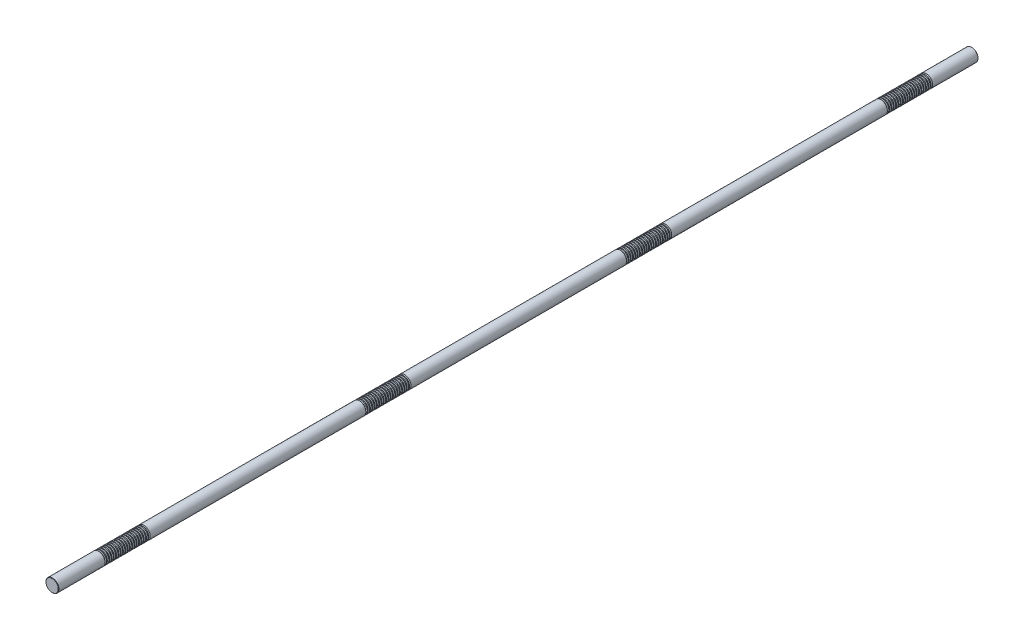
from build123d import *

# Parameters (mm, degrees)
SKETCH1_R           = 14
BOSS_EXTRUDE1_DEPTH = 1000
CHAMFER1_SIZE       = 0.7
LPATTERN1_COUNT     = 20
LPATTERN1_PITCH     = 5
LPATTERN2_COUNT     = 4
LPATTERN2_PITCH     = 567


with BuildPart() as part:
    # Sketch1 → Boss-Extrude1 (new, symmetric)
    with BuildSketch(Plane.XY):
        Circle(SKETCH1_R)
    extrude(amount=BOSS_EXTRUDE1_DEPTH, both=True)

    # Chamfer1
    chamfer1_edges = [part.edges().sort_by_distance(p)[0] for p in [
        (-14, 0, -1000),
        (-14, 0, 1000),
    ]]
    chamfer(chamfer1_edges, length=CHAMFER1_SIZE)

    # Sketch2 → Cut-Revolve1 (revolve, cut)
    with BuildSketch(Plane(origin=(0, 0, 0), x_dir=(0, 0, -1), z_dir=(1, 0, 0)), mode=Mode.PRIVATE) as cut_revolve1_sk:
        Polygon((900.36843014, 14), (897.13156986, 14), (897.86843014, 11.25), (899.63156986, 11.25), align=None)
    cut_revolve1 = revolve(cut_revolve1_sk.sketch.rotate(Axis((0, 0, 1000), (0, 0, -1)), 90), axis=Axis((0, 0, 1000), (0, 0, -1)), mode=Mode.SUBTRACT)

    # LPattern1: Cut-Revolve1 ×20
    with Locations(*[(0, 0, i * LPATTERN1_PITCH) for i in range(1, LPATTERN1_COUNT)]):
        add(cut_revolve1, mode=Mode.SUBTRACT)

    # LPattern2: Cut-Revolve1 ×4
    with Locations(*[(0, 0, i * LPATTERN2_PITCH) for i in range(1, LPATTERN2_COUNT)]):
        add(cut_revolve1, mode=Mode.SUBTRACT)

    # LPattern2 copy 1 sketch → LPattern2 copy 1 (revolve, cut)
    with BuildSketch(Plane(origin=(0, 0, 572), x_dir=(0, 0, -1), z_dir=(1, 0, 0))):
        Polygon((900.36843014, 14), (897.13156986, 14), (897.86843014, 11.25), (899.63156986, 11.25), align=None)
    revolve(axis=Axis((0, 0, 1572), (0, 0, -1)), mode=Mode.SUBTRACT)

    # LPattern2 copy 2 sketch → LPattern2 copy 2 (revolve, cut)
    with BuildSketch(Plane(origin=(0, 0, 1139), x_dir=(0, 0, -1), z_dir=(1, 0, 0))):
        Polygon((900.36843014, 14), (897.13156986, 14), (897.86843014, 11.25), (899.63156986, 11.25), align=None)
    revolve(axis=Axis((0, 0, 2139), (0, 0, -1)), mode=Mode.SUBTRACT)

    # LPattern2 copy 3 sketch → LPattern2 copy 3 (revolve, cut)
    with BuildSketch(Plane(origin=(0, 0, 1706), x_dir=(0, 0, -1), z_dir=(1, 0, 0))):
        Polygon((900.36843014, 14), (897.13156986, 14), (897.86843014, 11.25), (899.63156986, 11.25), align=None)
    revolve(axis=Axis((0, 0, 2706), (0, 0, -1)), mode=Mode.SUBTRACT)

    # LPattern2 copy 4 sketch → LPattern2 copy 4 (revolve, cut)
    with BuildSketch(Plane(origin=(0, 0, 577), x_dir=(0, 0, -1), z_dir=(1, 0, 0))):
        Polygon((900.36843014, 14), (897.13156986, 14), (897.86843014, 11.25), (899.63156986, 11.25), align=None)
    revolve(axis=Axis((0, 0, 1577), (0, 0, -1)), mode=Mode.SUBTRACT)

    # LPattern2 copy 5 sketch → LPattern2 copy 5 (revolve, cut)
    with BuildSketch(Plane(origin=(0, 0, 1144), x_dir=(0, 0, -1), z_dir=(1, 0, 0))):
        Polygon((900.36843014, 14), (897.13156986, 14), (897.86843014, 11.25), (899.63156986, 11.25), align=None)
    revolve(axis=Axis((0, 0, 2144), (0, 0, -1)), mode=Mode.SUBTRACT)

    # LPattern2 copy 6 sketch → LPattern2 copy 6 (revolve, cut)
    with BuildSketch(Plane(origin=(0, 0, 1711), x_dir=(0, 0, -1), z_dir=(1, 0, 0))):
        Polygon((900.36843014, 14), (897.13156986, 14), (897.86843014, 11.25), (899.63156986, 11.25), align=None)
    revolve(axis=Axis((0, 0, 2711), (0, 0, -1)), mode=Mode.SUBTRACT)

    # LPattern2 copy 7 sketch → LPattern2 copy 7 (revolve, cut)
    with BuildSketch(Plane(origin=(0, 0, 582), x_dir=(0, 0, -1), z_dir=(1, 0, 0))):
        Polygon((900.36843014, 14), (897.13156986, 14), (897.86843014, 11.25), (899.63156986, 11.25), align=None)
    revolve(axis=Axis((0, 0, 1582), (0, 0, -1)), mode=Mode.SUBTRACT)

    # LPattern2 copy 8 sketch → LPattern2 copy 8 (revolve, cut)
    with BuildSketch(Plane(origin=(0, 0, 1149), x_dir=(0, 0, -1), z_dir=(1, 0, 0))):
        Polygon((900.36843014, 14), (897.13156986, 14), (897.86843014, 11.25), (899.63156986, 11.25), align=None)
    revolve(axis=Axis((0, 0, 2149), (0, 0, -1)), mode=Mode.SUBTRACT)

    # LPattern2 copy 9 sketch → LPattern2 copy 9 (revolve, cut)
    with BuildSketch(Plane(origin=(0, 0, 1716), x_dir=(0, 0, -1), z_dir=(1, 0, 0))):
        Polygon((900.36843014, 14), (897.13156986, 14), (897.86843014, 11.25), (899.63156986, 11.25), align=None)
    revolve(axis=Axis((0, 0, 2716), (0, 0, -1)), mode=Mode.SUBTRACT)

    # LPattern2 copy 10 sketch → LPattern2 copy 10 (revolve, cut)
    with BuildSketch(Plane(origin=(0, 0, 587), x_dir=(0, 0, -1), z_dir=(1, 0, 0))):
        Polygon((900.36843014, 14), (897.13156986, 14), (897.86843014, 11.25), (899.63156986, 11.25), align=None)
    revolve(axis=Axis((0, 0, 1587), (0, 0, -1)), mode=Mode.SUBTRACT)

    # LPattern2 copy 11 sketch → LPattern2 copy 11 (revolve, cut)
    with BuildSketch(Plane(origin=(0, 0, 1154), x_dir=(0, 0, -1), z_dir=(1, 0, 0))):
        Polygon((900.36843014, 14), (897.13156986, 14), (897.86843014, 11.25), (899.63156986, 11.25), align=None)
    revolve(axis=Axis((0, 0, 2154), (0, 0, -1)), mode=Mode.SUBTRACT)

    # LPattern2 copy 12 sketch → LPattern2 copy 12 (revolve, cut)
    with BuildSketch(Plane(origin=(0, 0, 1721), x_dir=(0, 0, -1), z_dir=(1, 0, 0))):
        Polygon((900.36843014, 14), (897.13156986, 14), (897.86843014, 11.25), (899.63156986, 11.25), align=None)
    revolve(axis=Axis((0, 0, 2721), (0, 0, -1)), mode=Mode.SUBTRACT)

    # LPattern2 copy 13 sketch → LPattern2 copy 13 (revolve, cut)
    with BuildSketch(Plane(origin=(0, 0, 592), x_dir=(0, 0, -1), z_dir=(1, 0, 0))):
        Polygon((900.36843014, 14), (897.13156986, 14), (897.86843014, 11.25), (899.63156986, 11.25), align=None)
    revolve(axis=Axis((0, 0, 1592), (0, 0, -1)), mode=Mode.SUBTRACT)

    # LPattern2 copy 14 sketch → LPattern2 copy 14 (revolve, cut)
    with BuildSketch(Plane(origin=(0, 0, 1159), x_dir=(0, 0, -1), z_dir=(1, 0, 0))):
        Polygon((900.36843014, 14), (897.13156986, 14), (897.86843014, 11.25), (899.63156986, 11.25), align=None)
    revolve(axis=Axis((0, 0, 2159), (0, 0, -1)), mode=Mode.SUBTRACT)

    # LPattern2 copy 15 sketch → LPattern2 copy 15 (revolve, cut)
    with BuildSketch(Plane(origin=(0, 0, 1726), x_dir=(0, 0, -1), z_dir=(1, 0, 0))):
        Polygon((900.36843014, 14), (897.13156986, 14), (897.86843014, 11.25), (899.63156986, 11.25), align=None)
    revolve(axis=Axis((0, 0, 2726), (0, 0, -1)), mode=Mode.SUBTRACT)

    # LPattern2 copy 16 sketch → LPattern2 copy 16 (revolve, cut)
    with BuildSketch(Plane(origin=(0, 0, 597), x_dir=(0, 0, -1), z_dir=(1, 0, 0))):
        Polygon((900.36843014, 14), (897.13156986, 14), (897.86843014, 11.25), (899.63156986, 11.25), align=None)
    revolve(axis=Axis((0, 0, 1597), (0, 0, -1)), mode=Mode.SUBTRACT)

    # LPattern2 copy 17 sketch → LPattern2 copy 17 (revolve, cut)
    with BuildSketch(Plane(origin=(0, 0, 1164), x_dir=(0, 0, -1), z_dir=(1, 0, 0))):
        Polygon((900.36843014, 14), (897.13156986, 14), (897.86843014, 11.25), (899.63156986, 11.25), align=None)
    revolve(axis=Axis((0, 0, 2164), (0, 0, -1)), mode=Mode.SUBTRACT)

    # LPattern2 copy 18 sketch → LPattern2 copy 18 (revolve, cut)
    with BuildSketch(Plane(origin=(0, 0, 1731), x_dir=(0, 0, -1), z_dir=(1, 0, 0))):
        Polygon((900.36843014, 14), (897.13156986, 14), (897.86843014, 11.25), (899.63156986, 11.25), align=None)
    revolve(axis=Axis((0, 0, 2731), (0, 0, -1)), mode=Mode.SUBTRACT)

    # LPattern2 copy 19 sketch → LPattern2 copy 19 (revolve, cut)
    with BuildSketch(Plane(origin=(0, 0, 602), x_dir=(0, 0, -1), z_dir=(1, 0, 0))):
        Polygon((900.36843014, 14), (897.13156986, 14), (897.86843014, 11.25), (899.63156986, 11.25), align=None)
    revolve(axis=Axis((0, 0, 1602), (0, 0, -1)), mode=Mode.SUBTRACT)

    # LPattern2 copy 20 sketch → LPattern2 copy 20 (revolve, cut)
    with BuildSketch(Plane(origin=(0, 0, 1169), x_dir=(0, 0, -1), z_dir=(1, 0, 0))):
        Polygon((900.36843014, 14), (897.13156986, 14), (897.86843014, 11.25), (899.63156986, 11.25), align=None)
    revolve(axis=Axis((0, 0, 2169), (0, 0, -1)), mode=Mode.SUBTRACT)

    # LPattern2 copy 21 sketch → LPattern2 copy 21 (revolve, cut)
    with BuildSketch(Plane(origin=(0, 0, 1736), x_dir=(0, 0, -1), z_dir=(1, 0, 0))):
        Polygon((900.36843014, 14), (897.13156986, 14), (897.86843014, 11.25), (899.63156986, 11.25), align=None)
    revolve(axis=Axis((0, 0, 2736), (0, 0, -1)), mode=Mode.SUBTRACT)

    # LPattern2 copy 22 sketch → LPattern2 copy 22 (revolve, cut)
    with BuildSketch(Plane(origin=(0, 0, 607), x_dir=(0, 0, -1), z_dir=(1, 0, 0))):
        Polygon((900.36843014, 14), (897.13156986, 14), (897.86843014, 11.25), (899.63156986, 11.25), align=None)
    revolve(axis=Axis((0, 0, 1607), (0, 0, -1)), mode=Mode.SUBTRACT)

    # LPattern2 copy 23 sketch → LPattern2 copy 23 (revolve, cut)
    with BuildSketch(Plane(origin=(0, 0, 1174), x_dir=(0, 0, -1), z_dir=(1, 0, 0))):
        Polygon((900.36843014, 14), (897.13156986, 14), (897.86843014, 11.25), (899.63156986, 11.25), align=None)
    revolve(axis=Axis((0, 0, 2174), (0, 0, -1)), mode=Mode.SUBTRACT)

    # LPattern2 copy 24 sketch → LPattern2 copy 24 (revolve, cut)
    with BuildSketch(Plane(origin=(0, 0, 1741), x_dir=(0, 0, -1), z_dir=(1, 0, 0))):
        Polygon((900.36843014, 14), (897.13156986, 14), (897.86843014, 11.25), (899.63156986, 11.25), align=None)
    revolve(axis=Axis((0, 0, 2741), (0, 0, -1)), mode=Mode.SUBTRACT)

    # LPattern2 copy 25 sketch → LPattern2 copy 25 (revolve, cut)
    with BuildSketch(Plane(origin=(0, 0, 612), x_dir=(0, 0, -1), z_dir=(1, 0, 0))):
        Polygon((900.36843014, 14), (897.13156986, 14), (897.86843014, 11.25), (899.63156986, 11.25), align=None)
    revolve(axis=Axis((0, 0, 1612), (0, 0, -1)), mode=Mode.SUBTRACT)

    # LPattern2 copy 26 sketch → LPattern2 copy 26 (revolve, cut)
    with BuildSketch(Plane(origin=(0, 0, 1179), x_dir=(0, 0, -1), z_dir=(1, 0, 0))):
        Polygon((900.36843014, 14), (897.13156986, 14), (897.86843014, 11.25), (899.63156986, 11.25), align=None)
    revolve(axis=Axis((0, 0, 2179), (0, 0, -1)), mode=Mode.SUBTRACT)

    # LPattern2 copy 27 sketch → LPattern2 copy 27 (revolve, cut)
    with BuildSketch(Plane(origin=(0, 0, 1746), x_dir=(0, 0, -1), z_dir=(1, 0, 0))):
        Polygon((900.36843014, 14), (897.13156986, 14), (897.86843014, 11.25), (899.63156986, 11.25), align=None)
    revolve(axis=Axis((0, 0, 2746), (0, 0, -1)), mode=Mode.SUBTRACT)

    # LPattern2 copy 28 sketch → LPattern2 copy 28 (revolve, cut)
    with BuildSketch(Plane(origin=(0, 0, 617), x_dir=(0, 0, -1), z_dir=(1, 0, 0))):
        Polygon((900.36843014, 14), (897.13156986, 14), (897.86843014, 11.25), (899.63156986, 11.25), align=None)
    revolve(axis=Axis((0, 0, 1617), (0, 0, -1)), mode=Mode.SUBTRACT)

    # LPattern2 copy 29 sketch → LPattern2 copy 29 (revolve, cut)
    with BuildSketch(Plane(origin=(0, 0, 1184), x_dir=(0, 0, -1), z_dir=(1, 0, 0))):
        Polygon((900.36843014, 14), (897.13156986, 14), (897.86843014, 11.25), (899.63156986, 11.25), align=None)
    revolve(axis=Axis((0, 0, 2184), (0, 0, -1)), mode=Mode.SUBTRACT)

    # LPattern2 copy 30 sketch → LPattern2 copy 30 (revolve, cut)
    with BuildSketch(Plane(origin=(0, 0, 1751), x_dir=(0, 0, -1), z_dir=(1, 0, 0))):
        Polygon((900.36843014, 14), (897.13156986, 14), (897.86843014, 11.25), (899.63156986, 11.25), align=None)
    revolve(axis=Axis((0, 0, 2751), (0, 0, -1)), mode=Mode.SUBTRACT)

    # LPattern2 copy 31 sketch → LPattern2 copy 31 (revolve, cut)
    with BuildSketch(Plane(origin=(0, 0, 622), x_dir=(0, 0, -1), z_dir=(1, 0, 0))):
        Polygon((900.36843014, 14), (897.13156986, 14), (897.86843014, 11.25), (899.63156986, 11.25), align=None)
    revolve(axis=Axis((0, 0, 1622), (0, 0, -1)), mode=Mode.SUBTRACT)

    # LPattern2 copy 32 sketch → LPattern2 copy 32 (revolve, cut)
    with BuildSketch(Plane(origin=(0, 0, 1189), x_dir=(0, 0, -1), z_dir=(1, 0, 0))):
        Polygon((900.36843014, 14), (897.13156986, 14), (897.86843014, 11.25), (899.63156986, 11.25), align=None)
    revolve(axis=Axis((0, 0, 2189), (0, 0, -1)), mode=Mode.SUBTRACT)

    # LPattern2 copy 33 sketch → LPattern2 copy 33 (revolve, cut)
    with BuildSketch(Plane(origin=(0, 0, 1756), x_dir=(0, 0, -1), z_dir=(1, 0, 0))):
        Polygon((900.36843014, 14), (897.13156986, 14), (897.86843014, 11.25), (899.63156986, 11.25), align=None)
    revolve(axis=Axis((0, 0, 2756), (0, 0, -1)), mode=Mode.SUBTRACT)

    # LPattern2 copy 34 sketch → LPattern2 copy 34 (revolve, cut)
    with BuildSketch(Plane(origin=(0, 0, 627), x_dir=(0, 0, -1), z_dir=(1, 0, 0))):
        Polygon((900.36843014, 14), (897.13156986, 14), (897.86843014, 11.25), (899.63156986, 11.25), align=None)
    revolve(axis=Axis((0, 0, 1627), (0, 0, -1)), mode=Mode.SUBTRACT)

    # LPattern2 copy 35 sketch → LPattern2 copy 35 (revolve, cut)
    with BuildSketch(Plane(origin=(0, 0, 1194), x_dir=(0, 0, -1), z_dir=(1, 0, 0))):
        Polygon((900.36843014, 14), (897.13156986, 14), (897.86843014, 11.25), (899.63156986, 11.25), align=None)
    revolve(axis=Axis((0, 0, 2194), (0, 0, -1)), mode=Mode.SUBTRACT)

    # LPattern2 copy 36 sketch → LPattern2 copy 36 (revolve, cut)
    with BuildSketch(Plane(origin=(0, 0, 1761), x_dir=(0, 0, -1), z_dir=(1, 0, 0))):
        Polygon((900.36843014, 14), (897.13156986, 14), (897.86843014, 11.25), (899.63156986, 11.25), align=None)
    revolve(axis=Axis((0, 0, 2761), (0, 0, -1)), mode=Mode.SUBTRACT)

    # LPattern2 copy 37 sketch → LPattern2 copy 37 (revolve, cut)
    with BuildSketch(Plane(origin=(0, 0, 632), x_dir=(0, 0, -1), z_dir=(1, 0, 0))):
        Polygon((900.36843014, 14), (897.13156986, 14), (897.86843014, 11.25), (899.63156986, 11.25), align=None)
    revolve(axis=Axis((0, 0, 1632), (0, 0, -1)), mode=Mode.SUBTRACT)

    # LPattern2 copy 38 sketch → LPattern2 copy 38 (revolve, cut)
    with BuildSketch(Plane(origin=(0, 0, 1199), x_dir=(0, 0, -1), z_dir=(1, 0, 0))):
        Polygon((900.36843014, 14), (897.13156986, 14), (897.86843014, 11.25), (899.63156986, 11.25), align=None)
    revolve(axis=Axis((0, 0, 2199), (0, 0, -1)), mode=Mode.SUBTRACT)

    # LPattern2 copy 39 sketch → LPattern2 copy 39 (revolve, cut)
    with BuildSketch(Plane(origin=(0, 0, 1766), x_dir=(0, 0, -1), z_dir=(1, 0, 0))):
        Polygon((900.36843014, 14), (897.13156986, 14), (897.86843014, 11.25), (899.63156986, 11.25), align=None)
    revolve(axis=Axis((0, 0, 2766), (0, 0, -1)), mode=Mode.SUBTRACT)

    # LPattern2 copy 40 sketch → LPattern2 copy 40 (revolve, cut)
    with BuildSketch(Plane(origin=(0, 0, 637), x_dir=(0, 0, -1), z_dir=(1, 0, 0))):
        Polygon((900.36843014, 14), (897.13156986, 14), (897.86843014, 11.25), (899.63156986, 11.25), align=None)
    revolve(axis=Axis((0, 0, 1637), (0, 0, -1)), mode=Mode.SUBTRACT)

    # LPattern2 copy 41 sketch → LPattern2 copy 41 (revolve, cut)
    with BuildSketch(Plane(origin=(0, 0, 1204), x_dir=(0, 0, -1), z_dir=(1, 0, 0))):
        Polygon((900.36843014, 14), (897.13156986, 14), (897.86843014, 11.25), (899.63156986, 11.25), align=None)
    revolve(axis=Axis((0, 0, 2204), (0, 0, -1)), mode=Mode.SUBTRACT)

    # LPattern2 copy 42 sketch → LPattern2 copy 42 (revolve, cut)
    with BuildSketch(Plane(origin=(0, 0, 1771), x_dir=(0, 0, -1), z_dir=(1, 0, 0))):
        Polygon((900.36843014, 14), (897.13156986, 14), (897.86843014, 11.25), (899.63156986, 11.25), align=None)
    revolve(axis=Axis((0, 0, 2771), (0, 0, -1)), mode=Mode.SUBTRACT)

    # LPattern2 copy 43 sketch → LPattern2 copy 43 (revolve, cut)
    with BuildSketch(Plane(origin=(0, 0, 642), x_dir=(0, 0, -1), z_dir=(1, 0, 0))):
        Polygon((900.36843014, 14), (897.13156986, 14), (897.86843014, 11.25), (899.63156986, 11.25), align=None)
    revolve(axis=Axis((0, 0, 1642), (0, 0, -1)), mode=Mode.SUBTRACT)

    # LPattern2 copy 44 sketch → LPattern2 copy 44 (revolve, cut)
    with BuildSketch(Plane(origin=(0, 0, 1209), x_dir=(0, 0, -1), z_dir=(1, 0, 0))):
        Polygon((900.36843014, 14), (897.13156986, 14), (897.86843014, 11.25), (899.63156986, 11.25), align=None)
    revolve(axis=Axis((0, 0, 2209), (0, 0, -1)), mode=Mode.SUBTRACT)

    # LPattern2 copy 45 sketch → LPattern2 copy 45 (revolve, cut)
    with BuildSketch(Plane(origin=(0, 0, 1776), x_dir=(0, 0, -1), z_dir=(1, 0, 0))):
        Polygon((900.36843014, 14), (897.13156986, 14), (897.86843014, 11.25), (899.63156986, 11.25), align=None)
    revolve(axis=Axis((0, 0, 2776), (0, 0, -1)), mode=Mode.SUBTRACT)

    # LPattern2 copy 46 sketch → LPattern2 copy 46 (revolve, cut)
    with BuildSketch(Plane(origin=(0, 0, 647), x_dir=(0, 0, -1), z_dir=(1, 0, 0))):
        Polygon((900.36843014, 14), (897.13156986, 14), (897.86843014, 11.25), (899.63156986, 11.25), align=None)
    revolve(axis=Axis((0, 0, 1647), (0, 0, -1)), mode=Mode.SUBTRACT)

    # LPattern2 copy 47 sketch → LPattern2 copy 47 (revolve, cut)
    with BuildSketch(Plane(origin=(0, 0, 1214), x_dir=(0, 0, -1), z_dir=(1, 0, 0))):
        Polygon((900.36843014, 14), (897.13156986, 14), (897.86843014, 11.25), (899.63156986, 11.25), align=None)
    revolve(axis=Axis((0, 0, 2214), (0, 0, -1)), mode=Mode.SUBTRACT)

    # LPattern2 copy 48 sketch → LPattern2 copy 48 (revolve, cut)
    with BuildSketch(Plane(origin=(0, 0, 1781), x_dir=(0, 0, -1), z_dir=(1, 0, 0))):
        Polygon((900.36843014, 14), (897.13156986, 14), (897.86843014, 11.25), (899.63156986, 11.25), align=None)
    revolve(axis=Axis((0, 0, 2781), (0, 0, -1)), mode=Mode.SUBTRACT)

    # LPattern2 copy 49 sketch → LPattern2 copy 49 (revolve, cut)
    with BuildSketch(Plane(origin=(0, 0, 652), x_dir=(0, 0, -1), z_dir=(1, 0, 0))):
        Polygon((900.36843014, 14), (897.13156986, 14), (897.86843014, 11.25), (899.63156986, 11.25), align=None)
    revolve(axis=Axis((0, 0, 1652), (0, 0, -1)), mode=Mode.SUBTRACT)

    # LPattern2 copy 50 sketch → LPattern2 copy 50 (revolve, cut)
    with BuildSketch(Plane(origin=(0, 0, 1219), x_dir=(0, 0, -1), z_dir=(1, 0, 0))):
        Polygon((900.36843014, 14), (897.13156986, 14), (897.86843014, 11.25), (899.63156986, 11.25), align=None)
    revolve(axis=Axis((0, 0, 2219), (0, 0, -1)), mode=Mode.SUBTRACT)

    # LPattern2 copy 51 sketch → LPattern2 copy 51 (revolve, cut)
    with BuildSketch(Plane(origin=(0, 0, 1786), x_dir=(0, 0, -1), z_dir=(1, 0, 0))):
        Polygon((900.36843014, 14), (897.13156986, 14), (897.86843014, 11.25), (899.63156986, 11.25), align=None)
    revolve(axis=Axis((0, 0, 2786), (0, 0, -1)), mode=Mode.SUBTRACT)

    # LPattern2 copy 52 sketch → LPattern2 copy 52 (revolve, cut)
    with BuildSketch(Plane(origin=(0, 0, 657), x_dir=(0, 0, -1), z_dir=(1, 0, 0))):
        Polygon((900.36843014, 14), (897.13156986, 14), (897.86843014, 11.25), (899.63156986, 11.25), align=None)
    revolve(axis=Axis((0, 0, 1657), (0, 0, -1)), mode=Mode.SUBTRACT)

    # LPattern2 copy 53 sketch → LPattern2 copy 53 (revolve, cut)
    with BuildSketch(Plane(origin=(0, 0, 1224), x_dir=(0, 0, -1), z_dir=(1, 0, 0))):
        Polygon((900.36843014, 14), (897.13156986, 14), (897.86843014, 11.25), (899.63156986, 11.25), align=None)
    revolve(axis=Axis((0, 0, 2224), (0, 0, -1)), mode=Mode.SUBTRACT)

    # LPattern2 copy 54 sketch → LPattern2 copy 54 (revolve, cut)
    with BuildSketch(Plane(origin=(0, 0, 1791), x_dir=(0, 0, -1), z_dir=(1, 0, 0))):
        Polygon((900.36843014, 14), (897.13156986, 14), (897.86843014, 11.25), (899.63156986, 11.25), align=None)
    revolve(axis=Axis((0, 0, 2791), (0, 0, -1)), mode=Mode.SUBTRACT)

    # LPattern2 copy 55 sketch → LPattern2 copy 55 (revolve, cut)
    with BuildSketch(Plane(origin=(0, 0, 662), x_dir=(0, 0, -1), z_dir=(1, 0, 0))):
        Polygon((900.36843014, 14), (897.13156986, 14), (897.86843014, 11.25), (899.63156986, 11.25), align=None)
    revolve(axis=Axis((0, 0, 1662), (0, 0, -1)), mode=Mode.SUBTRACT)

    # LPattern2 copy 56 sketch → LPattern2 copy 56 (revolve, cut)
    with BuildSketch(Plane(origin=(0, 0, 1229), x_dir=(0, 0, -1), z_dir=(1, 0, 0))):
        Polygon((900.36843014, 14), (897.13156986, 14), (897.86843014, 11.25), (899.63156986, 11.25), align=None)
    revolve(axis=Axis((0, 0, 2229), (0, 0, -1)), mode=Mode.SUBTRACT)

    # LPattern2 copy 57 sketch → LPattern2 copy 57 (revolve, cut)
    with BuildSketch(Plane(origin=(0, 0, 1796), x_dir=(0, 0, -1), z_dir=(1, 0, 0))):
        Polygon((900.36843014, 14), (897.13156986, 14), (897.86843014, 11.25), (899.63156986, 11.25), align=None)
    revolve(axis=Axis((0, 0, 2796), (0, 0, -1)), mode=Mode.SUBTRACT)


solid = part.part
